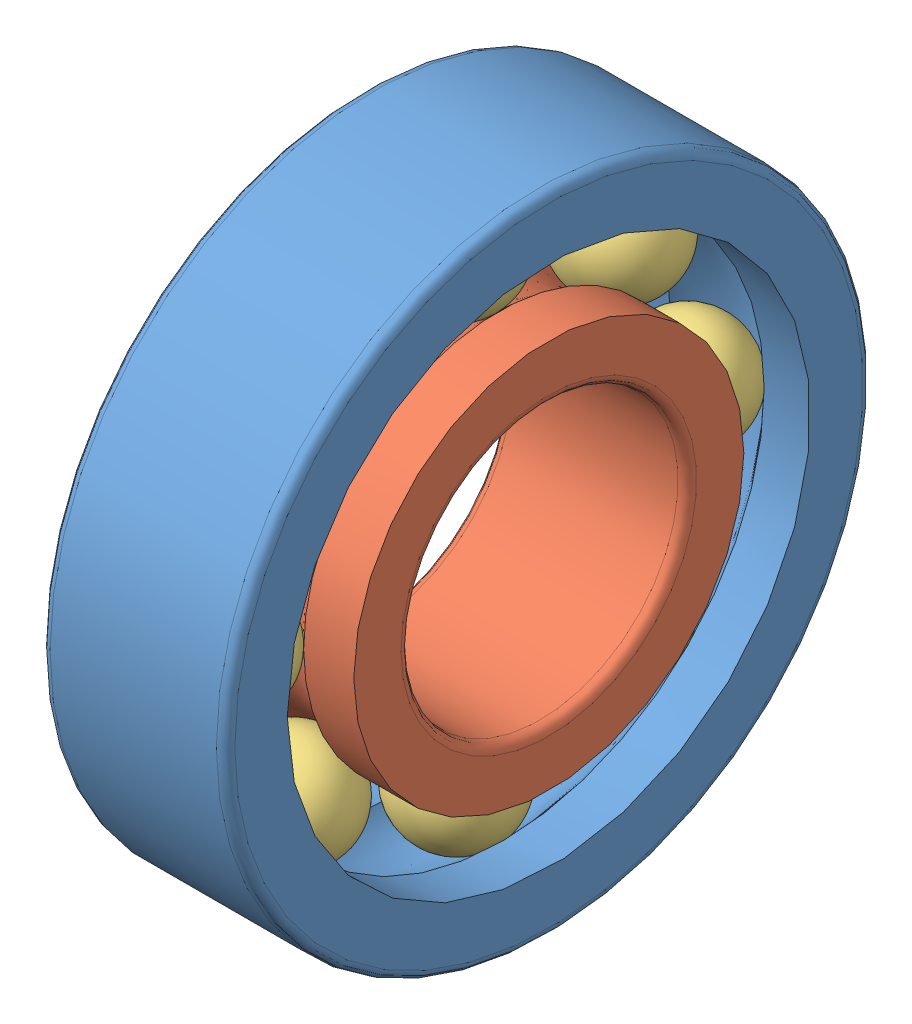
SolidWorks assembly Michaud_Chailly_L1_6001.sldasm, configuration Michaud Chailly L1-6001 (file format 3100). Lengths in mm.
Overall size (8 28 28).
10 component instances, 3 part files, 0 mates.
Components (placement in the parent):
- Michaud_Chailly_L1_6001_PART1-1: Michaud_Chailly_L1_6001_PART1.sldprt [Défaut] at origin size (8 28 28)
- Michaud_Chailly_L1_6001_PART2-1: Michaud_Chailly_L1_6001_PART2.sldprt [Défaut] at origin size (8 16.9 16.9)
- Michaud_Chailly_L1_6001_PART3-1: Michaud_Chailly_L1_6001_PART3.sldprt [Défaut] at origin size (4.8 4.8 4.8)
- Michaud_Chailly_L1_6001_PART3-2: Michaud_Chailly_L1_6001_PART3.sldprt [Défaut] x (1 0 0) z (0 0.707107 0.707107) size (4.8 4.8 4.8)
- Michaud_Chailly_L1_6001_PART3-3: Michaud_Chailly_L1_6001_PART3.sldprt [Défaut] x (1 0 0) z (0 1 0) size (4.8 4.8 4.8)
- Michaud_Chailly_L1_6001_PART3-4: Michaud_Chailly_L1_6001_PART3.sldprt [Défaut] x (1 0 0) z (0 0.707107 -0.707107) size (4.8 4.8 4.8)
- Michaud_Chailly_L1_6001_PART3-5: Michaud_Chailly_L1_6001_PART3.sldprt [Défaut] x (1 0 0) z (0 0 -1) size (4.8 4.8 4.8)
- Michaud_Chailly_L1_6001_PART3-6: Michaud_Chailly_L1_6001_PART3.sldprt [Défaut] x (1 0 0) z (0 -0.707107 -0.707107) size (4.8 4.8 4.8)
- Michaud_Chailly_L1_6001_PART3-7: Michaud_Chailly_L1_6001_PART3.sldprt [Défaut] x (1 0 0) z (0 -1 0) size (4.8 4.8 4.8)
- Michaud_Chailly_L1_6001_PART3-8: Michaud_Chailly_L1_6001_PART3.sldprt [Défaut] x (1 0 0) z (0 -0.707107 0.707107) size (4.8 4.8 4.8)
